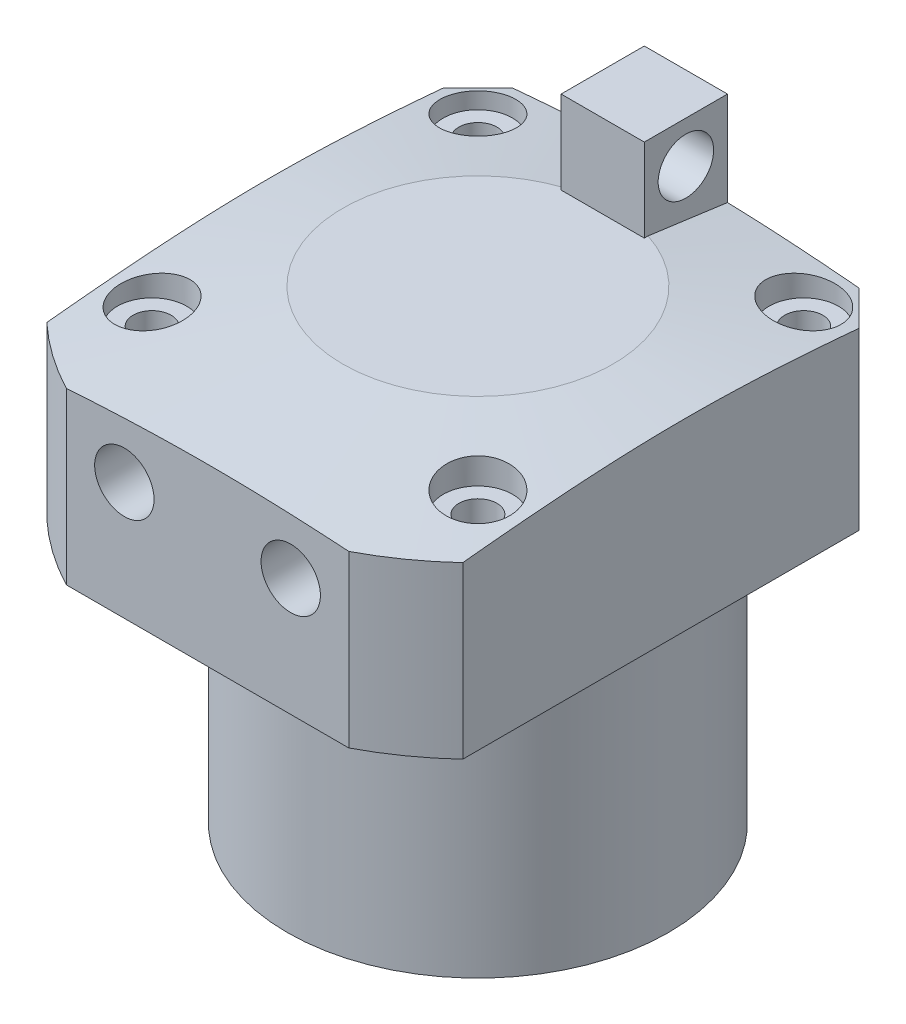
from build123d import *

# Parameters (mm, degrees)
SKETCH2_OUTSIDE_W                            = 118.268
SKETCH2_OUTSIDE_H                            = 118.268
SKETCH2_OUTSIDE_W_2                          = 60
SKETCH2_OUTSIDE_H_2                          = 69
CUT_EXTRUDE2_DEPTH                           = 92.438503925
CHAMFER1_SIZE                                = 5
G1_8_TAPPED_HOLE1_D                          = 8.566
G1_8_TAPPED_HOLE1_DEPTH                      = 22.18
F_8_0_8_DIAMETER_HOLE2_D                     = 8
F_8_0_8_DIAMETER_HOLE2_DEPTH                 = 1.5
CBORE_FOR_M5_HEX_SOCKET_HEAD_CAP_SCR_2_COUNT = 2
CBORE_FOR_M5_HEX_SOCKET_HEAD_CAP_SCR_2_PITCH = 47
CBORE_FOR_M5_HEX_SOCKET_HEAD_CAP_SCR_3_COUNT = 2
CBORE_FOR_M5_HEX_SOCKET_HEAD_CAP_SCR_3_PITCH = 66.468037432
CBORE_FOR_M5_HEX_SOCKET_HEAD_CAP_SCR_4_COUNT = 2
CBORE_FOR_M5_HEX_SOCKET_HEAD_CAP_SCR_4_PITCH = 47
SKETCH13_W                                   = 12
SKETCH13_H                                   = 12
BOSS_EXTRUDE1_DEPTH                          = 12
BOSS_EXTRUDE1_DIRECTION_2_REACH              = 85.126
SKETCH14_R                                   = 4
CUT_EXTRUDE3_DEPTH                           = 15


with BuildPart() as part:
    # Sketch1 → Revolve1 (revolve)
    with BuildSketch(Plane.XY, mode=Mode.PRIVATE) as revolve1_sk:
        Polygon((0, 0), (-27.5, 0), (-27.5, 39), (-44, 39), (-44, 63.554988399), (-19.487468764, 67), (0, 67), align=None)
    revolve(revolve1_sk.sketch.rotate(Axis((0, 87.050829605, 0), (0, -1, 0)), 270), axis=Axis((0, 87.050829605, 0), (0, -1, 0)))

    # Sketch2 outside → Cut-Extrude2 (cut, through all)
    with BuildSketch(Plane(origin=(0, 67, 0), x_dir=(1, 0, 0), z_dir=(0, 1, 0))):
        Rectangle(SKETCH2_OUTSIDE_W, SKETCH2_OUTSIDE_H)
        with Locations((0, -4.5)):
            Rectangle(SKETCH2_OUTSIDE_W_2, SKETCH2_OUTSIDE_H_2, mode=Mode.SUBTRACT)
    extrude(amount=-CUT_EXTRUDE2_DEPTH, mode=Mode.SUBTRACT)

    # Chamfer1
    chamfer1_edges = [part.edges().sort_by_distance(p)[0] for p in [
        (30, 51.388071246, -30),
        (-30, 51.388071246, -30),
    ]]
    chamfer(chamfer1_edges, length=CHAMFER1_SIZE)

    # G1_8 Tapped Hole1
    with Locations(Plane.XY.offset(39)):
        with Locations((-12, 56), (12, 56)):
            Hole(G1_8_TAPPED_HOLE1_D / 2, depth=G1_8_TAPPED_HOLE1_DEPTH)

    # 8.0 _8_ Diameter Hole2
    with Locations(Plane.XZ.offset(-39)):
        with Locations((-12, 33.5), (12, 33.5)):
            Hole(F_8_0_8_DIAMETER_HOLE2_D / 2, depth=F_8_0_8_DIAMETER_HOLE2_DEPTH)

    # Sketch11 → CBORE for M5 Hex Socket Head Cap Screw2 (revolve, cut)
    with BuildSketch(Plane(origin=(-23.5, 67, 23.5), x_dir=(0, 0, 1), z_dir=(1, 0, 0))):
        Polygon((0, 0), (0, 28), (2.775, 28), (2.75, 27.975), (2.75, 5), (5, 5), (5, 0), align=None)
    cbore_for_m5_hex_socket_head_cap_screw2 = revolve(axis=Axis((-23.5, 73.35, 23.5), (0, -1, 0)), mode=Mode.SUBTRACT)

    # CBORE for M5 Hex Socket Head Cap Scr 2: CBORE for M5 Hex Socket Head Cap Screw2 ×2
    with Locations(*[(0, 0, -i * CBORE_FOR_M5_HEX_SOCKET_HEAD_CAP_SCR_2_PITCH) for i in range(1, CBORE_FOR_M5_HEX_SOCKET_HEAD_CAP_SCR_2_COUNT)]):
        add(cbore_for_m5_hex_socket_head_cap_screw2, mode=Mode.SUBTRACT)

    # CBORE for M5 Hex Socket Head Cap Scr 3: CBORE for M5 Hex Socket Head Cap Screw2 ×2
    with Locations(*[Vector(0.7071067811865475, 0, -0.7071067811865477) * (i * CBORE_FOR_M5_HEX_SOCKET_HEAD_CAP_SCR_3_PITCH) for i in range(1, CBORE_FOR_M5_HEX_SOCKET_HEAD_CAP_SCR_3_COUNT)]):
        add(cbore_for_m5_hex_socket_head_cap_screw2, mode=Mode.SUBTRACT)

    # CBORE for M5 Hex Socket Head Cap Scr 4: CBORE for M5 Hex Socket Head Cap Screw2 ×2
    with Locations(*[(i * CBORE_FOR_M5_HEX_SOCKET_HEAD_CAP_SCR_4_PITCH, 0, 0) for i in range(1, CBORE_FOR_M5_HEX_SOCKET_HEAD_CAP_SCR_4_COUNT)]):
        add(cbore_for_m5_hex_socket_head_cap_screw2, mode=Mode.SUBTRACT)

    # Sketch13 → Boss-Extrude1 (add)
    with BuildSketch(Plane(origin=(0, 67, 0), x_dir=(1, 0, 0), z_dir=(0, 1, 0))):
        with Locations((0, 24)):
            Rectangle(SKETCH13_W, SKETCH13_H)
    extrude(amount=BOSS_EXTRUDE1_DEPTH)

    # Boss-Extrude1 direction 2: up to this cone (the profile starts outside it)
    boss_extrude1_direction_2_end = Plane(origin=(0, 67, 0), z_dir=(0, -1, 0)).offset(-2.738784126) * Cone(7.115e-06, 767.408661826, 107.852252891, align=(Align.CENTER, Align.CENTER, Align.MIN), mode=Mode.PRIVATE)
    # Sketch13 → Boss-Extrude1 direction 2 (add, up to the surface)
    with BuildSketch(Plane(origin=(0, 67, 0), x_dir=(1, 0, 0), z_dir=(0, 1, 0)), mode=Mode.PRIVATE) as boss_extrude1_direction_2_sk1:
        with Locations((0, 24)):
            Rectangle(SKETCH13_W, SKETCH13_H)
    boss_extrude1_direction_2_tool1 = extrude(boss_extrude1_direction_2_sk1.sketch, amount=-BOSS_EXTRUDE1_DIRECTION_2_REACH, mode=Mode.PRIVATE) - boss_extrude1_direction_2_end
    add(boss_extrude1_direction_2_tool1.solids().sort_by_distance((0, 67, -24))[0])

    # Sketch14 → Cut-Extrude3 (cut)
    with BuildSketch(Plane(origin=(6, 0, 0), x_dir=(0, 0, -1), z_dir=(1, 0, 0))):
        with Locations((24, 73)):
            Circle(SKETCH14_R)
    extrude(amount=-CUT_EXTRUDE3_DEPTH, mode=Mode.SUBTRACT)


solid = part.part
